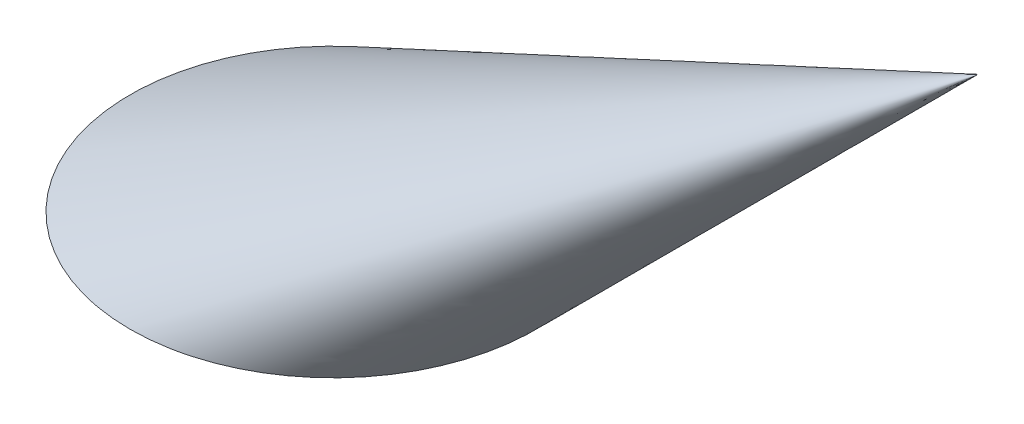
ISO-10303-21;
HEADER;
FILE_DESCRIPTION(('STEP AP214'),'2;1');
FILE_NAME('part.step','',(''),(''),'','','');
FILE_SCHEMA(('AUTOMOTIVE_DESIGN { 1 0 10303 214 1 1 1 1 }'));
ENDSEC;
DATA;
#1=APPLICATION_CONTEXT('core data for automotive mechanical design processes');
#2=APPLICATION_PROTOCOL_DEFINITION('international standard','automotive_design',2000,#1);
#3=PRODUCT_CONTEXT('',#1,'mechanical');
#4=PRODUCT('Part','Part','',(#3));
#5=PRODUCT_RELATED_PRODUCT_CATEGORY('part','',(#4));
#6=PRODUCT_DEFINITION_FORMATION('','',#4);
#7=PRODUCT_DEFINITION_CONTEXT('part definition',#1,'design');
#8=PRODUCT_DEFINITION('design','',#6,#7);
#9=PRODUCT_DEFINITION_SHAPE('','',#8);
#10=(LENGTH_UNIT() NAMED_UNIT(*) SI_UNIT(.MILLI.,.METRE.));
#11=(NAMED_UNIT(*) PLANE_ANGLE_UNIT() SI_UNIT($,.RADIAN.));
#12=(NAMED_UNIT(*) SI_UNIT($,.STERADIAN.) SOLID_ANGLE_UNIT());
#13=UNCERTAINTY_MEASURE_WITH_UNIT(LENGTH_MEASURE(1.E-05),#10,'distance_accuracy_value','');
#14=(GEOMETRIC_REPRESENTATION_CONTEXT(3) GLOBAL_UNCERTAINTY_ASSIGNED_CONTEXT((#13)) GLOBAL_UNIT_ASSIGNED_CONTEXT((#10,
#11,#12)) REPRESENTATION_CONTEXT('',''));
#15=CARTESIAN_POINT('',(0.,0.,0.));
#16=DIRECTION('',(0.,0.,1.));
#17=DIRECTION('',(1.,0.,0.));
#18=AXIS2_PLACEMENT_3D('',#15,#16,#17);
#19=CARTESIAN_POINT('',(0.,0.,0.));
#20=DIRECTION('',(0.,1.,0.));
#21=DIRECTION('',(0.,0.,1.));
#22=AXIS2_PLACEMENT_3D('',#19,#20,#21);
#23=PLANE('',#22);
#24=CARTESIAN_POINT('',(0.,0.,0.));
#25=DIRECTION('',(0.,1.,0.));
#26=DIRECTION('',(0.,0.,1.));
#27=AXIS2_PLACEMENT_3D('',#24,#25,#26);
#28=CIRCLE('',#27,460.);
#29=CARTESIAN_POINT('',(0.,0.,460.));
#30=VERTEX_POINT('',#29);
#31=EDGE_CURVE('E12',#30,#30,#28,.T.);
#32=ORIENTED_EDGE('',*,*,#31,.F.);
#33=EDGE_LOOP('',(#32));
#34=FACE_BOUND('',#33,.T.);
#35=ADVANCED_FACE('F41',(#34),#23,.F.);
#36=CARTESIAN_POINT('',(0.,0.,460.));
#37=CARTESIAN_POINT('',(1460.00000000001,1000.,0.));
#38=CARTESIAN_POINT('',(7.52051664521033,0.,460.));
#39=CARTESIAN_POINT('',(1460.00000000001,1000.,0.));
#40=CARTESIAN_POINT('',(15.3267860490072,0.,459.816306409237));
#41=CARTESIAN_POINT('',(1460.00000000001,1000.,0.));
#42=CARTESIAN_POINT('',(31.5471216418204,0.,458.988807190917));
#43=CARTESIAN_POINT('',(1460.00000000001,1000.,0.));
#44=CARTESIAN_POINT('',(39.9613099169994,0.,458.345102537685));
#45=CARTESIAN_POINT('',(1460.00000000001,1000.,0.));
#46=CARTESIAN_POINT('',(57.4284089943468,0.,456.485615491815));
#47=CARTESIAN_POINT('',(1460.00000000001,1000.,0.));
#48=CARTESIAN_POINT('',(66.4814931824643,0.,455.269933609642));
#49=CARTESIAN_POINT('',(1460.00000000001,1000.,0.));
#50=CARTESIAN_POINT('',(85.2473976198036,0.,452.132041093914));
#51=CARTESIAN_POINT('',(1460.00000000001,1000.,0.));
#52=CARTESIAN_POINT('',(94.9604574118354,0.,450.209916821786));
#53=CARTESIAN_POINT('',(1460.00000000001,1000.,0.));
#54=CARTESIAN_POINT('',(115.051280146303,0.,445.499338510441));
#55=CARTESIAN_POINT('',(1460.00000000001,1000.,0.));
#56=CARTESIAN_POINT('',(125.429364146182,0.,442.710933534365));
#57=CARTESIAN_POINT('',(1460.00000000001,1000.,0.));
#58=CARTESIAN_POINT('',(146.830806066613,0.,436.080509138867));
#59=CARTESIAN_POINT('',(1460.00000000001,1000.,0.));
#60=CARTESIAN_POINT('',(157.854578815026,0.,432.238465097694));
#61=CARTESIAN_POINT('',(1460.00000000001,1000.,0.));
#62=CARTESIAN_POINT('',(180.49257612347,0.,423.285469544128));
#63=CARTESIAN_POINT('',(1460.00000000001,1000.,0.));
#64=CARTESIAN_POINT('',(192.107311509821,0.,418.174366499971));
#65=CARTESIAN_POINT('',(1460.00000000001,1000.,0.));
#66=CARTESIAN_POINT('',(215.823127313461,0.,406.44236694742));
#67=CARTESIAN_POINT('',(1460.00000000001,1000.,0.));
#68=CARTESIAN_POINT('',(227.924795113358,0.,399.821120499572));
#69=CARTESIAN_POINT('',(1460.00000000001,1000.,0.));
#70=CARTESIAN_POINT('',(252.444504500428,0.,384.809579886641));
#71=CARTESIAN_POINT('',(1460.00000000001,1000.,0.));
#72=CARTESIAN_POINT('',(264.863151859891,0.,376.418652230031));
#73=CARTESIAN_POINT('',(1460.00000000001,1000.,0.));
#74=CARTESIAN_POINT('',(289.76280916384,0.,357.604537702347));
#75=CARTESIAN_POINT('',(1460.00000000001,1000.,0.));
#76=CARTESIAN_POINT('',(302.244325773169,0.,347.180351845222));
#77=CARTESIAN_POINT('',(1460.00000000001,1000.,0.));
#78=CARTESIAN_POINT('',(320.74692114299,0.,329.837641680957));
#79=CARTESIAN_POINT('',(1460.00000000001,1000.,0.));
#80=CARTESIAN_POINT('',(326.876998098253,0.,323.772586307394));
#81=CARTESIAN_POINT('',(1460.00000000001,1000.,0.));
#82=CARTESIAN_POINT('',(339.007247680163,0.,311.048783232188));
#83=CARTESIAN_POINT('',(1460.00000000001,1000.,0.));
#84=CARTESIAN_POINT('',(345.007419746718,0.,304.389985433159));
#85=CARTESIAN_POINT('',(1460.00000000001,1000.,0.));
#86=CARTESIAN_POINT('',(356.815704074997,0.,290.458148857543));
#87=CARTESIAN_POINT('',(1460.00000000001,1000.,0.));
#88=CARTESIAN_POINT('',(362.623805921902,0.,283.185054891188));
#89=CARTESIAN_POINT('',(1460.00000000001,1000.,0.));
#90=CARTESIAN_POINT('',(373.97877500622,0.,268.010588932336));
#91=CARTESIAN_POINT('',(1460.00000000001,1000.,0.));
#92=CARTESIAN_POINT('',(379.52561963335,0.,260.109158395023));
#93=CARTESIAN_POINT('',(1460.00000000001,1000.,0.));
#94=CARTESIAN_POINT('',(390.282366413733,0.,243.672207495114));
#95=CARTESIAN_POINT('',(1460.00000000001,1000.,0.));
#96=CARTESIAN_POINT('',(395.492231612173,0.,235.136627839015));
#97=CARTESIAN_POINT('',(1460.00000000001,1000.,0.));
#98=CARTESIAN_POINT('',(405.493664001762,0.,217.435570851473));
#99=CARTESIAN_POINT('',(1460.00000000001,1000.,0.));
#100=CARTESIAN_POINT('',(410.285178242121,0.,208.270037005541));
#101=CARTESIAN_POINT('',(1460.00000000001,1000.,0.));
#102=CARTESIAN_POINT('',(419.364248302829,0.,189.325019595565));
#103=CARTESIAN_POINT('',(1460.00000000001,1000.,0.));
#104=CARTESIAN_POINT('',(423.651734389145,0.,179.545486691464));
#105=CARTESIAN_POINT('',(1460.00000000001,1000.,0.));
#106=CARTESIAN_POINT('',(431.634621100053,0.,159.401780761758));
#107=CARTESIAN_POINT('',(1460.00000000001,1000.,0.));
#108=CARTESIAN_POINT('',(435.329935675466,0.,149.037570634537));
#109=CARTESIAN_POINT('',(1460.00000000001,1000.,0.));
#110=CARTESIAN_POINT('',(442.040225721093,0.,127.768498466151));
#111=CARTESIAN_POINT('',(1460.00000000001,1000.,0.));
#112=CARTESIAN_POINT('',(445.055100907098,0.,116.863616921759));
#113=CARTESIAN_POINT('',(1460.00000000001,1000.,0.));
#114=CARTESIAN_POINT('',(450.318936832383,0.,94.5727388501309));
#115=CARTESIAN_POINT('',(1460.00000000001,1000.,0.));
#116=CARTESIAN_POINT('',(452.567786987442,0.,83.1867455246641));
#117=CARTESIAN_POINT('',(1460.00000000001,1000.,0.));
#118=CARTESIAN_POINT('',(456.219856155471,0.,60.0089934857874));
#119=CARTESIAN_POINT('',(1460.00000000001,1000.,0.));
#120=CARTESIAN_POINT('',(457.622960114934,0.,48.2172648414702));
#121=CARTESIAN_POINT('',(1460.00000000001,1000.,0.));
#122=CARTESIAN_POINT('',(459.51308805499,0.,24.3187203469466));
#123=CARTESIAN_POINT('',(1460.00000000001,1000.,0.));
#124=CARTESIAN_POINT('',(460.,0.,12.211963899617));
#125=CARTESIAN_POINT('',(1460.00000000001,1000.,0.));
#126=CARTESIAN_POINT('',(460.,0.,-12.211963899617));
#127=CARTESIAN_POINT('',(1460.00000000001,1000.,0.));
#128=CARTESIAN_POINT('',(459.513088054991,0.,-24.3187203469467));
#129=CARTESIAN_POINT('',(1460.00000000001,1000.,0.));
#130=CARTESIAN_POINT('',(457.622960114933,0.,-48.2172648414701));
#131=CARTESIAN_POINT('',(1460.00000000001,1000.,0.));
#132=CARTESIAN_POINT('',(456.219856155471,0.,-60.0089934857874));
#133=CARTESIAN_POINT('',(1460.00000000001,1000.,0.));
#134=CARTESIAN_POINT('',(452.567786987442,0.,-83.1867455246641));
#135=CARTESIAN_POINT('',(1460.00000000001,1000.,0.));
#136=CARTESIAN_POINT('',(450.318936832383,0.,-94.5727388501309));
#137=CARTESIAN_POINT('',(1460.00000000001,1000.,0.));
#138=CARTESIAN_POINT('',(445.055100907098,0.,-116.863616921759));
#139=CARTESIAN_POINT('',(1460.00000000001,1000.,0.));
#140=CARTESIAN_POINT('',(442.040225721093,0.,-127.768498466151));
#141=CARTESIAN_POINT('',(1460.00000000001,1000.,0.));
#142=CARTESIAN_POINT('',(435.329935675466,0.,-149.037570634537));
#143=CARTESIAN_POINT('',(1460.00000000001,1000.,0.));
#144=CARTESIAN_POINT('',(431.634621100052,0.,-159.401780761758));
#145=CARTESIAN_POINT('',(1460.00000000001,1000.,0.));
#146=CARTESIAN_POINT('',(423.651734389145,0.,-179.545486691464));
#147=CARTESIAN_POINT('',(1460.00000000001,1000.,0.));
#148=CARTESIAN_POINT('',(419.364248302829,0.,-189.325019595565));
#149=CARTESIAN_POINT('',(1460.00000000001,1000.,0.));
#150=CARTESIAN_POINT('',(410.285178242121,0.,-208.270037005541));
#151=CARTESIAN_POINT('',(1460.00000000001,1000.,0.));
#152=CARTESIAN_POINT('',(405.493664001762,0.,-217.435570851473));
#153=CARTESIAN_POINT('',(1460.00000000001,1000.,0.));
#154=CARTESIAN_POINT('',(395.492231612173,0.,-235.136627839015));
#155=CARTESIAN_POINT('',(1460.00000000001,1000.,0.));
#156=CARTESIAN_POINT('',(390.282366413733,0.,-243.672207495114));
#157=CARTESIAN_POINT('',(1460.00000000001,1000.,0.));
#158=CARTESIAN_POINT('',(379.52561963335,0.,-260.109158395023));
#159=CARTESIAN_POINT('',(1460.00000000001,1000.,0.));
#160=CARTESIAN_POINT('',(373.97877500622,0.,-268.010588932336));
#161=CARTESIAN_POINT('',(1460.00000000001,1000.,0.));
#162=CARTESIAN_POINT('',(362.623805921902,0.,-283.185054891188));
#163=CARTESIAN_POINT('',(1460.00000000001,1000.,0.));
#164=CARTESIAN_POINT('',(356.815704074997,0.,-290.458148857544));
#165=CARTESIAN_POINT('',(1460.00000000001,1000.,0.));
#166=CARTESIAN_POINT('',(345.007419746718,0.,-304.389985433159));
#167=CARTESIAN_POINT('',(1460.00000000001,1000.,0.));
#168=CARTESIAN_POINT('',(339.007247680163,0.,-311.048783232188));
#169=CARTESIAN_POINT('',(1460.00000000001,1000.,0.));
#170=CARTESIAN_POINT('',(326.876998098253,0.,-323.772586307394));
#171=CARTESIAN_POINT('',(1460.00000000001,1000.,0.));
#172=CARTESIAN_POINT('',(320.74692114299,0.,-329.837641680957));
#173=CARTESIAN_POINT('',(1460.00000000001,1000.,0.));
#174=CARTESIAN_POINT('',(302.244325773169,0.,-347.180351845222));
#175=CARTESIAN_POINT('',(1460.00000000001,1000.,0.));
#176=CARTESIAN_POINT('',(289.76280916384,0.,-357.604537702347));
#177=CARTESIAN_POINT('',(1460.00000000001,1000.,0.));
#178=CARTESIAN_POINT('',(264.863151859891,0.,-376.418652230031));
#179=CARTESIAN_POINT('',(1460.00000000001,1000.,0.));
#180=CARTESIAN_POINT('',(252.444504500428,0.,-384.809579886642));
#181=CARTESIAN_POINT('',(1460.00000000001,1000.,0.));
#182=CARTESIAN_POINT('',(227.924795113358,0.,-399.821120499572));
#183=CARTESIAN_POINT('',(1460.00000000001,1000.,0.));
#184=CARTESIAN_POINT('',(215.823127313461,0.,-406.44236694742));
#185=CARTESIAN_POINT('',(1460.00000000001,1000.,0.));
#186=CARTESIAN_POINT('',(192.10731150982,0.,-418.174366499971));
#187=CARTESIAN_POINT('',(1460.00000000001,1000.,0.));
#188=CARTESIAN_POINT('',(180.49257612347,0.,-423.285469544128));
#189=CARTESIAN_POINT('',(1460.00000000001,1000.,0.));
#190=CARTESIAN_POINT('',(157.854578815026,0.,-432.238465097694));
#191=CARTESIAN_POINT('',(1460.00000000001,1000.,0.));
#192=CARTESIAN_POINT('',(146.830806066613,0.,-436.080509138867));
#193=CARTESIAN_POINT('',(1460.00000000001,1000.,0.));
#194=CARTESIAN_POINT('',(125.429364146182,0.,-442.710933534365));
#195=CARTESIAN_POINT('',(1460.00000000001,1000.,0.));
#196=CARTESIAN_POINT('',(115.051280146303,0.,-445.499338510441));
#197=CARTESIAN_POINT('',(1460.00000000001,1000.,0.));
#198=CARTESIAN_POINT('',(94.9604574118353,0.,-450.209916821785));
#199=CARTESIAN_POINT('',(1460.00000000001,1000.,0.));
#200=CARTESIAN_POINT('',(85.2473976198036,0.,-452.132041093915));
#201=CARTESIAN_POINT('',(1460.00000000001,1000.,0.));
#202=CARTESIAN_POINT('',(66.4814931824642,0.,-455.269933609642));
#203=CARTESIAN_POINT('',(1460.00000000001,1000.,0.));
#204=CARTESIAN_POINT('',(57.4284089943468,0.,-456.485615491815));
#205=CARTESIAN_POINT('',(1460.00000000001,1000.,0.));
#206=CARTESIAN_POINT('',(39.9613099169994,0.,-458.345102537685));
#207=CARTESIAN_POINT('',(1460.00000000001,1000.,0.));
#208=CARTESIAN_POINT('',(31.5471216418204,0.,-458.988807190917));
#209=CARTESIAN_POINT('',(1460.00000000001,1000.,0.));
#210=CARTESIAN_POINT('',(15.3267860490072,0.,-459.816306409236));
#211=CARTESIAN_POINT('',(1460.00000000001,1000.,0.));
#212=CARTESIAN_POINT('',(7.5205166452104,0.,-460.));
#213=CARTESIAN_POINT('',(1460.00000000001,1000.,0.));
#214=CARTESIAN_POINT('',(-7.52051664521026,0.,-460.));
#215=CARTESIAN_POINT('',(1460.00000000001,1000.,0.));
#216=CARTESIAN_POINT('',(-15.3267860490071,0.,-459.816306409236));
#217=CARTESIAN_POINT('',(1460.00000000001,1000.,0.));
#218=CARTESIAN_POINT('',(-31.5471216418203,0.,-458.988807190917));
#219=CARTESIAN_POINT('',(1460.00000000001,1000.,0.));
#220=CARTESIAN_POINT('',(-39.9613099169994,0.,-458.345102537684));
#221=CARTESIAN_POINT('',(1460.00000000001,1000.,0.));
#222=CARTESIAN_POINT('',(-57.4284089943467,0.,-456.485615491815));
#223=CARTESIAN_POINT('',(1460.00000000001,1000.,0.));
#224=CARTESIAN_POINT('',(-66.4814931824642,0.,-455.269933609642));
#225=CARTESIAN_POINT('',(1460.00000000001,1000.,0.));
#226=CARTESIAN_POINT('',(-85.2473976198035,0.,-452.132041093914));
#227=CARTESIAN_POINT('',(1460.00000000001,1000.,0.));
#228=CARTESIAN_POINT('',(-94.9604574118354,0.,-450.209916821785));
#229=CARTESIAN_POINT('',(1460.00000000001,1000.,0.));
#230=CARTESIAN_POINT('',(-115.051280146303,0.,-445.499338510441));
#231=CARTESIAN_POINT('',(1460.00000000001,1000.,0.));
#232=CARTESIAN_POINT('',(-125.429364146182,0.,-442.710933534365));
#233=CARTESIAN_POINT('',(1460.00000000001,1000.,0.));
#234=CARTESIAN_POINT('',(-146.830806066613,0.,-436.080509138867));
#235=CARTESIAN_POINT('',(1460.00000000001,1000.,0.));
#236=CARTESIAN_POINT('',(-157.854578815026,0.,-432.238465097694));
#237=CARTESIAN_POINT('',(1460.00000000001,1000.,0.));
#238=CARTESIAN_POINT('',(-180.49257612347,0.,-423.285469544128));
#239=CARTESIAN_POINT('',(1460.00000000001,1000.,0.));
#240=CARTESIAN_POINT('',(-192.10731150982,0.,-418.174366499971));
#241=CARTESIAN_POINT('',(1460.00000000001,1000.,0.));
#242=CARTESIAN_POINT('',(-215.823127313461,0.,-406.44236694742));
#243=CARTESIAN_POINT('',(1460.00000000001,1000.,0.));
#244=CARTESIAN_POINT('',(-227.924795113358,0.,-399.821120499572));
#245=CARTESIAN_POINT('',(1460.00000000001,1000.,0.));
#246=CARTESIAN_POINT('',(-252.444504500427,0.,-384.809579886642));
#247=CARTESIAN_POINT('',(1460.00000000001,1000.,0.));
#248=CARTESIAN_POINT('',(-264.86315185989,0.,-376.418652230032));
#249=CARTESIAN_POINT('',(1460.00000000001,1000.,0.));
#250=CARTESIAN_POINT('',(-289.762809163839,0.,-357.604537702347));
#251=CARTESIAN_POINT('',(1460.00000000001,1000.,0.));
#252=CARTESIAN_POINT('',(-302.244325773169,0.,-347.180351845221));
#253=CARTESIAN_POINT('',(1460.00000000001,1000.,0.));
#254=CARTESIAN_POINT('',(-320.74692114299,0.,-329.837641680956));
#255=CARTESIAN_POINT('',(1460.00000000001,1000.,0.));
#256=CARTESIAN_POINT('',(-326.876998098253,0.,-323.772586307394));
#257=CARTESIAN_POINT('',(1460.00000000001,1000.,0.));
#258=CARTESIAN_POINT('',(-339.007247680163,0.,-311.048783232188));
#259=CARTESIAN_POINT('',(1460.00000000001,1000.,0.));
#260=CARTESIAN_POINT('',(-345.007419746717,0.,-304.38998543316));
#261=CARTESIAN_POINT('',(1460.00000000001,1000.,0.));
#262=CARTESIAN_POINT('',(-356.815704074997,0.,-290.458148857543));
#263=CARTESIAN_POINT('',(1460.00000000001,1000.,0.));
#264=CARTESIAN_POINT('',(-362.623805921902,0.,-283.185054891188));
#265=CARTESIAN_POINT('',(1460.00000000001,1000.,0.));
#266=CARTESIAN_POINT('',(-373.97877500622,0.,-268.010588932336));
#267=CARTESIAN_POINT('',(1460.00000000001,1000.,0.));
#268=CARTESIAN_POINT('',(-379.52561963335,0.,-260.109158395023));
#269=CARTESIAN_POINT('',(1460.00000000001,1000.,0.));
#270=CARTESIAN_POINT('',(-390.282366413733,0.,-243.672207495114));
#271=CARTESIAN_POINT('',(1460.00000000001,1000.,0.));
#272=CARTESIAN_POINT('',(-395.492231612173,0.,-235.136627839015));
#273=CARTESIAN_POINT('',(1460.00000000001,1000.,0.));
#274=CARTESIAN_POINT('',(-405.493664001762,0.,-217.435570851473));
#275=CARTESIAN_POINT('',(1460.00000000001,1000.,0.));
#276=CARTESIAN_POINT('',(-410.285178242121,0.,-208.270037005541));
#277=CARTESIAN_POINT('',(1460.00000000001,1000.,0.));
#278=CARTESIAN_POINT('',(-419.364248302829,0.,-189.325019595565));
#279=CARTESIAN_POINT('',(1460.00000000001,1000.,0.));
#280=CARTESIAN_POINT('',(-423.651734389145,0.,-179.545486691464));
#281=CARTESIAN_POINT('',(1460.00000000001,1000.,0.));
#282=CARTESIAN_POINT('',(-431.634621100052,0.,-159.401780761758));
#283=CARTESIAN_POINT('',(1460.00000000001,1000.,0.));
#284=CARTESIAN_POINT('',(-435.329935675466,0.,-149.037570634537));
#285=CARTESIAN_POINT('',(1460.00000000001,1000.,0.));
#286=CARTESIAN_POINT('',(-442.040225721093,0.,-127.768498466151));
#287=CARTESIAN_POINT('',(1460.00000000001,1000.,0.));
#288=CARTESIAN_POINT('',(-445.055100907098,0.,-116.863616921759));
#289=CARTESIAN_POINT('',(1460.00000000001,1000.,0.));
#290=CARTESIAN_POINT('',(-450.318936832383,0.,-94.5727388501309));
#291=CARTESIAN_POINT('',(1460.00000000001,1000.,0.));
#292=CARTESIAN_POINT('',(-452.567786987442,0.,-83.1867455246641));
#293=CARTESIAN_POINT('',(1460.00000000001,1000.,0.));
#294=CARTESIAN_POINT('',(-456.219856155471,0.,-60.0089934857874));
#295=CARTESIAN_POINT('',(1460.00000000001,1000.,0.));
#296=CARTESIAN_POINT('',(-457.622960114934,0.,-48.2172648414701));
#297=CARTESIAN_POINT('',(1460.00000000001,1000.,0.));
#298=CARTESIAN_POINT('',(-459.513088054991,0.,-24.3187203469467));
#299=CARTESIAN_POINT('',(1460.00000000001,1000.,0.));
#300=CARTESIAN_POINT('',(-460.,0.,-12.2119638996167));
#301=CARTESIAN_POINT('',(1460.00000000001,1000.,0.));
#302=CARTESIAN_POINT('',(-460.,0.,12.2119638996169));
#303=CARTESIAN_POINT('',(1460.00000000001,1000.,0.));
#304=CARTESIAN_POINT('',(-459.513088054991,0.,24.3187203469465));
#305=CARTESIAN_POINT('',(1460.00000000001,1000.,0.));
#306=CARTESIAN_POINT('',(-457.622960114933,0.,48.2172648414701));
#307=CARTESIAN_POINT('',(1460.00000000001,1000.,0.));
#308=CARTESIAN_POINT('',(-456.219856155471,0.,60.0089934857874));
#309=CARTESIAN_POINT('',(1460.00000000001,1000.,0.));
#310=CARTESIAN_POINT('',(-452.567786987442,0.,83.1867455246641));
#311=CARTESIAN_POINT('',(1460.00000000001,1000.,0.));
#312=CARTESIAN_POINT('',(-450.318936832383,0.,94.572738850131));
#313=CARTESIAN_POINT('',(1460.00000000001,1000.,0.));
#314=CARTESIAN_POINT('',(-445.055100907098,0.,116.863616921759));
#315=CARTESIAN_POINT('',(1460.00000000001,1000.,0.));
#316=CARTESIAN_POINT('',(-442.040225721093,0.,127.768498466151));
#317=CARTESIAN_POINT('',(1460.00000000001,1000.,0.));
#318=CARTESIAN_POINT('',(-435.329935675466,0.,149.037570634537));
#319=CARTESIAN_POINT('',(1460.00000000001,1000.,0.));
#320=CARTESIAN_POINT('',(-431.634621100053,0.,159.401780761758));
#321=CARTESIAN_POINT('',(1460.00000000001,1000.,0.));
#322=CARTESIAN_POINT('',(-423.651734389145,0.,179.545486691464));
#323=CARTESIAN_POINT('',(1460.00000000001,1000.,0.));
#324=CARTESIAN_POINT('',(-419.364248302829,0.,189.325019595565));
#325=CARTESIAN_POINT('',(1460.00000000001,1000.,0.));
#326=CARTESIAN_POINT('',(-410.28517824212,0.,208.270037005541));
#327=CARTESIAN_POINT('',(1460.00000000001,1000.,0.));
#328=CARTESIAN_POINT('',(-405.493664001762,0.,217.435570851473));
#329=CARTESIAN_POINT('',(1460.00000000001,1000.,0.));
#330=CARTESIAN_POINT('',(-395.492231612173,0.,235.136627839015));
#331=CARTESIAN_POINT('',(1460.00000000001,1000.,0.));
#332=CARTESIAN_POINT('',(-390.282366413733,0.,243.672207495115));
#333=CARTESIAN_POINT('',(1460.00000000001,1000.,0.));
#334=CARTESIAN_POINT('',(-379.52561963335,0.,260.109158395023));
#335=CARTESIAN_POINT('',(1460.00000000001,1000.,0.));
#336=CARTESIAN_POINT('',(-373.97877500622,0.,268.010588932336));
#337=CARTESIAN_POINT('',(1460.00000000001,1000.,0.));
#338=CARTESIAN_POINT('',(-362.623805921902,0.,283.185054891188));
#339=CARTESIAN_POINT('',(1460.00000000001,1000.,0.));
#340=CARTESIAN_POINT('',(-356.815704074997,0.,290.458148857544));
#341=CARTESIAN_POINT('',(1460.00000000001,1000.,0.));
#342=CARTESIAN_POINT('',(-345.007419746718,0.,304.389985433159));
#343=CARTESIAN_POINT('',(1460.00000000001,1000.,0.));
#344=CARTESIAN_POINT('',(-339.007247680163,0.,311.048783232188));
#345=CARTESIAN_POINT('',(1460.00000000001,1000.,0.));
#346=CARTESIAN_POINT('',(-326.876998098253,0.,323.772586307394));
#347=CARTESIAN_POINT('',(1460.00000000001,1000.,0.));
#348=CARTESIAN_POINT('',(-320.746921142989,0.,329.837641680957));
#349=CARTESIAN_POINT('',(1460.00000000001,1000.,0.));
#350=CARTESIAN_POINT('',(-302.244325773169,0.,347.180351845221));
#351=CARTESIAN_POINT('',(1460.00000000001,1000.,0.));
#352=CARTESIAN_POINT('',(-289.762809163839,0.,357.604537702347));
#353=CARTESIAN_POINT('',(1460.00000000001,1000.,0.));
#354=CARTESIAN_POINT('',(-264.863151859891,0.,376.418652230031));
#355=CARTESIAN_POINT('',(1460.00000000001,1000.,0.));
#356=CARTESIAN_POINT('',(-252.444504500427,0.,384.809579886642));
#357=CARTESIAN_POINT('',(1460.00000000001,1000.,0.));
#358=CARTESIAN_POINT('',(-227.924795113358,0.,399.821120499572));
#359=CARTESIAN_POINT('',(1460.00000000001,1000.,0.));
#360=CARTESIAN_POINT('',(-215.82312731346,0.,406.44236694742));
#361=CARTESIAN_POINT('',(1460.00000000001,1000.,0.));
#362=CARTESIAN_POINT('',(-192.10731150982,0.,418.174366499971));
#363=CARTESIAN_POINT('',(1460.00000000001,1000.,0.));
#364=CARTESIAN_POINT('',(-180.49257612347,0.,423.285469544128));
#365=CARTESIAN_POINT('',(1460.00000000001,1000.,0.));
#366=CARTESIAN_POINT('',(-157.854578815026,0.,432.238465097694));
#367=CARTESIAN_POINT('',(1460.00000000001,1000.,0.));
#368=CARTESIAN_POINT('',(-146.830806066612,0.,436.080509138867));
#369=CARTESIAN_POINT('',(1460.00000000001,1000.,0.));
#370=CARTESIAN_POINT('',(-125.429364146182,0.,442.710933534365));
#371=CARTESIAN_POINT('',(1460.00000000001,1000.,0.));
#372=CARTESIAN_POINT('',(-115.051280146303,0.,445.499338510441));
#373=CARTESIAN_POINT('',(1460.00000000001,1000.,0.));
#374=CARTESIAN_POINT('',(-94.9604574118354,0.,450.209916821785));
#375=CARTESIAN_POINT('',(1460.00000000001,1000.,0.));
#376=CARTESIAN_POINT('',(-85.2473976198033,0.,452.132041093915));
#377=CARTESIAN_POINT('',(1460.00000000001,1000.,0.));
#378=CARTESIAN_POINT('',(-66.4814931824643,0.,455.269933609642));
#379=CARTESIAN_POINT('',(1460.00000000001,1000.,0.));
#380=CARTESIAN_POINT('',(-57.4284089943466,0.,456.485615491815));
#381=CARTESIAN_POINT('',(1460.00000000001,1000.,0.));
#382=CARTESIAN_POINT('',(-39.9613099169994,0.,458.345102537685));
#383=CARTESIAN_POINT('',(1460.00000000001,1000.,0.));
#384=CARTESIAN_POINT('',(-31.5471216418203,0.,458.988807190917));
#385=CARTESIAN_POINT('',(1460.00000000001,1000.,0.));
#386=CARTESIAN_POINT('',(-15.3267860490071,0.,459.816306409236));
#387=CARTESIAN_POINT('',(1460.00000000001,1000.,0.));
#388=CARTESIAN_POINT('',(-7.52051664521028,0.,460.));
#389=CARTESIAN_POINT('',(1460.00000000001,1000.,0.));
#390=CARTESIAN_POINT('',(0.,0.,460.));
#391=CARTESIAN_POINT('',(1460.00000000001,1000.,0.));
#392=B_SPLINE_SURFACE_WITH_KNOTS('',3,1,((#36,#37),(#38,#39),(#40,#41),(#42,#43),(#44,#45),(#46,
#47),(#48,#49),(#50,#51),(#52,#53),(#54,#55),(#56,#57),(#58,#59),(#60,#61),(#62,#63),(#64,#65),
(#66,#67),(#68,#69),(#70,#71),(#72,#73),(#74,#75),(#76,#77),(#78,#79),(#80,#81),(#82,#83),(#84,
#85),(#86,#87),(#88,#89),(#90,#91),(#92,#93),(#94,#95),(#96,#97),(#98,#99),(#100,#101),(#102,
#103),(#104,#105),(#106,#107),(#108,#109),(#110,#111),(#112,#113),(#114,#115),(#116,#117),(#118,
#119),(#120,#121),(#122,#123),(#124,#125),(#126,#127),(#128,#129),(#130,#131),(#132,#133),(#134,
#135),(#136,#137),(#138,#139),(#140,#141),(#142,#143),(#144,#145),(#146,#147),(#148,#149),(#150,
#151),(#152,#153),(#154,#155),(#156,#157),(#158,#159),(#160,#161),(#162,#163),(#164,#165),(#166,
#167),(#168,#169),(#170,#171),(#172,#173),(#174,#175),(#176,#177),(#178,#179),(#180,#181),(#182,
#183),(#184,#185),(#186,#187),(#188,#189),(#190,#191),(#192,#193),(#194,#195),(#196,#197),(#198,
#199),(#200,#201),(#202,#203),(#204,#205),(#206,#207),(#208,#209),(#210,#211),(#212,#213),(#214,
#215),(#216,#217),(#218,#219),(#220,#221),(#222,#223),(#224,#225),(#226,#227),(#228,#229),(#230,
#231),(#232,#233),(#234,#235),(#236,#237),(#238,#239),(#240,#241),(#242,#243),(#244,#245),(#246,
#247),(#248,#249),(#250,#251),(#252,#253),(#254,#255),(#256,#257),(#258,#259),(#260,#261),(#262,
#263),(#264,#265),(#266,#267),(#268,#269),(#270,#271),(#272,#273),(#274,#275),(#276,#277),(#278,
#279),(#280,#281),(#282,#283),(#284,#285),(#286,#287),(#288,#289),(#290,#291),(#292,#293),(#294,
#295),(#296,#297),(#298,#299),(#300,#301),(#302,#303),(#304,#305),(#306,#307),(#308,#309),(#310,
#311),(#312,#313),(#314,#315),(#316,#317),(#318,#319),(#320,#321),(#322,#323),(#324,#325),(#326,
#327),(#328,#329),(#330,#331),(#332,#333),(#334,#335),(#336,#337),(#338,#339),(#340,#341),(#342,
#343),(#344,#345),(#346,#347),(#348,#349),(#350,#351),(#352,#353),(#354,#355),(#356,#357),(#358,
#359),(#360,#361),(#362,#363),(#364,#365),(#366,#367),(#368,#369),(#370,#371),(#372,#373),(#374,
#375),(#376,#377),(#378,#379),(#380,#381),(#382,#383),(#384,#385),(#386,#387),(#388,#389),(#390,
#391)),.UNSPECIFIED.,.T.,.F.,.F.,(4,2,2,2,2,2,2,2,2,2,2,2,2,2,2,2,2,2,2,2,2,2,2,2,2,2,2,2,2,2,2,
2,2,2,2,2,2,2,2,2,2,2,2,2,2,2,2,2,2,2,2,2,2,2,2,2,2,2,2,2,2,2,2,2,2,2,2,2,2,2,2,2,2,2,2,2,2,2,2,
2,2,2,2,2,2,2,2,2,4),(2,2),(0.,0.015625,0.03125,0.046875,0.0625,0.078125,0.09375,0.109375,0.125,
0.140625,0.15625,0.1640625,0.171875,0.1796875,0.1875,0.1953125,0.203125,0.2109375,0.21875,
0.2265625,0.234375,0.2421875,0.25,0.2578125,0.265625,0.2734375,0.28125,0.2890625,0.296875,
0.3046875,0.3125,0.3203125,0.328125,0.3359375,0.34375,0.359375,0.375,0.390625,0.40625,0.421875,
0.4375,0.453125,0.46875,0.484375,0.5,0.515625,0.53125,0.546875,0.5625,0.578125,0.59375,0.609375,
0.625,0.640625,0.65625,0.6640625,0.671875,0.6796875,0.6875,0.6953125,0.703125,0.7109375,0.71875,
0.7265625,0.734375,0.7421875,0.75,0.7578125,0.765625,0.7734375,0.78125,0.7890625,0.796875,
0.8046875,0.8125,0.8203125,0.828125,0.8359375,0.84375,0.859375,0.875,0.890625,0.90625,0.921875,
0.9375,0.953125,0.96875,0.984375,1.),(0.,1.),.UNSPECIFIED.);
#393=CARTESIAN_POINT('',(1460.00000000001,1000.,0.));
#394=VERTEX_POINT('',#393);
#395=VERTEX_LOOP('',#394);
#396=FACE_BOUND('',#395,.T.);
#397=ORIENTED_EDGE('',*,*,#31,.T.);
#398=EDGE_LOOP('',(#397));
#399=FACE_BOUND('',#398,.T.);
#400=ADVANCED_FACE('F43',(#396,#399),#392,.T.);
#401=CLOSED_SHELL('',(#35,#400));
#402=MANIFOLD_SOLID_BREP('B2',#401);
#403=ADVANCED_BREP_SHAPE_REPRESENTATION('',(#18,#402),#14);
#404=SHAPE_DEFINITION_REPRESENTATION(#9,#403);
ENDSEC;
END-ISO-10303-21;
